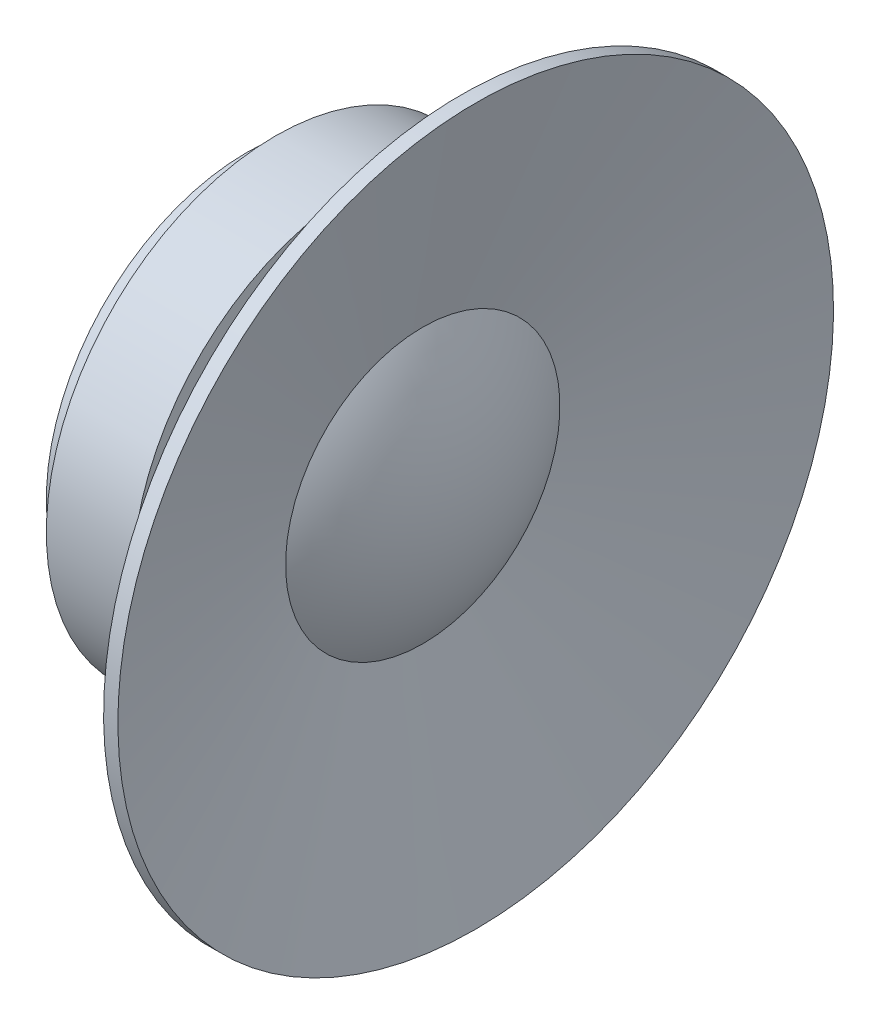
from build123d import *


with BuildPart() as part:
    # Esquisse1 → R_volution1 (revolve)
    with BuildSketch(Plane.XY, mode=Mode.PRIVATE) as r_volution1_sk:
        with BuildLine():
            Line((-16, 0), (-6, 0))
            Line((-6, 0), (-0.942501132, 0))
            ThreePointArc((-0.942501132, 0), (-1.645582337, 4.986087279), (-3.699997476, 9.583343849))
            Line((-3.699997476, 9.583343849), (0, 25))
            Line((0, 25), (-1, 25))
            Line((-1, 25), (-6, 14.5))
            Line((-6, 14.5), (-8, 14.5))
            Line((-8, 14.5), (-8, 16))
            Line((-8, 16), (-14, 16))
            Line((-14, 16), (-14, 14))
            Line((-14, 14), (-16, 14))
            Line((-16, 14), (-16, 0))
        make_face()
    revolve(r_volution1_sk.sketch.rotate(Axis((-16, 0, 0), (1, 0, 0)), 180), axis=Axis((-16, 0, 0), (1, 0, 0)))


solid = part.part
